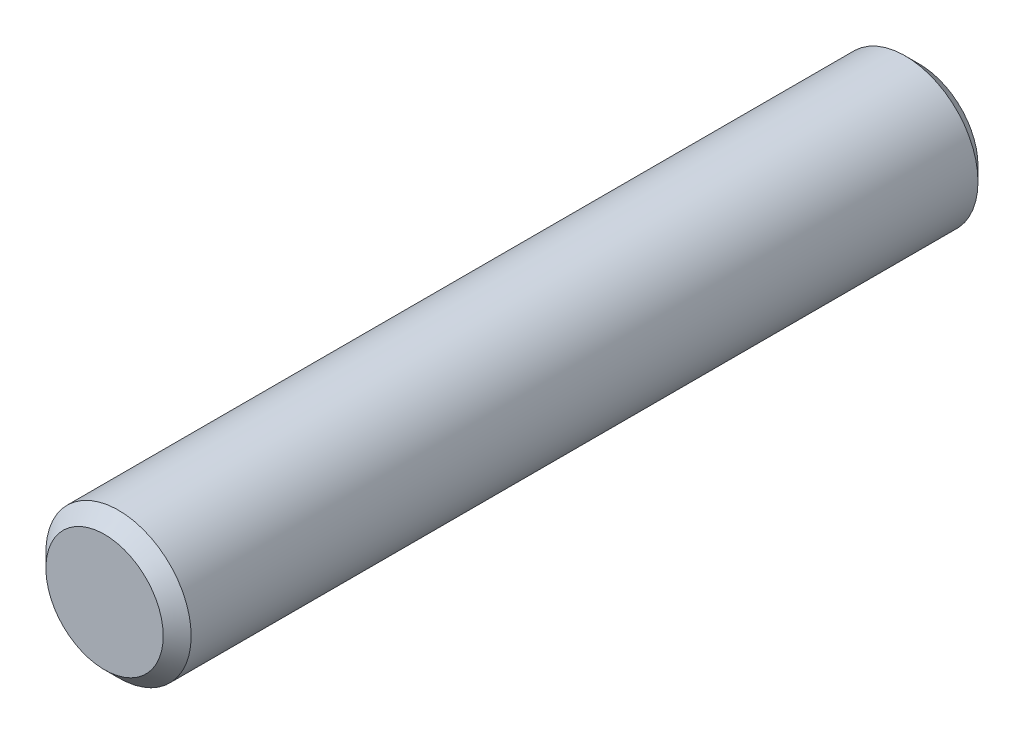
from build123d import *

# Parameters (mm, degrees)
SKETCH1_R           = 1.9812
BOSS_EXTRUDE1_DEPTH = 11.1125
CHAMFER1_SIZE       = 0.381


with BuildPart() as part:
    # Sketch1 → Boss-Extrude1 (new, symmetric)
    with BuildSketch(Plane.XY):
        Circle(SKETCH1_R)
    extrude(amount=BOSS_EXTRUDE1_DEPTH, both=True)

    # Chamfer1
    chamfer1_edges = [part.edges().sort_by_distance(p)[0] for p in [
        (-1.9812, 0, -11.1125),
        (-1.9812, 0, 11.1125),
    ]]
    chamfer(chamfer1_edges, length=CHAMFER1_SIZE)


solid = part.part
